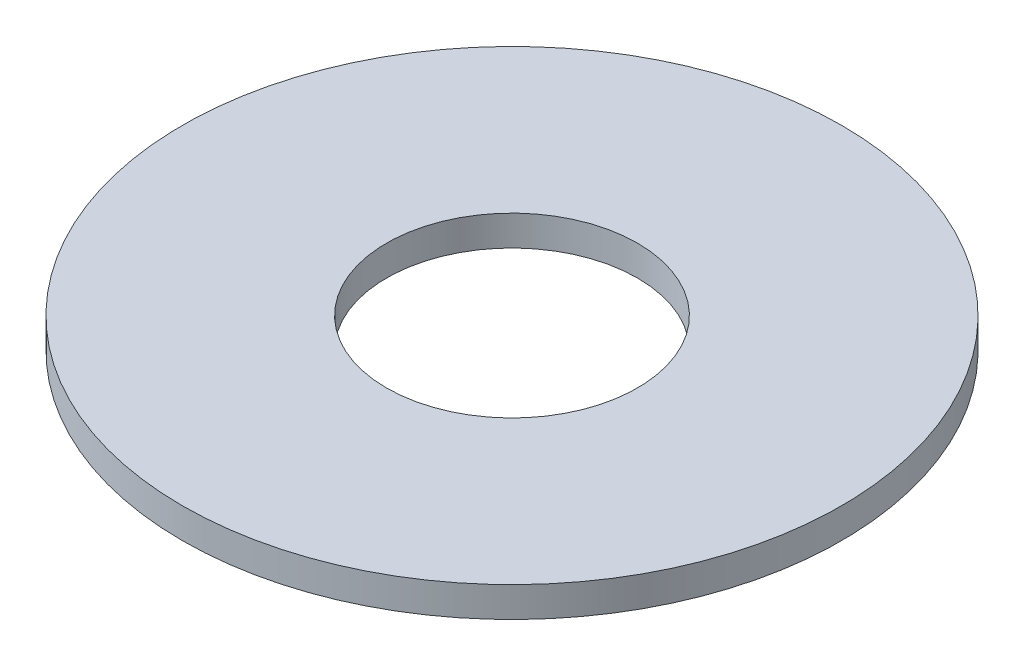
ISO-10303-21;
HEADER;
FILE_DESCRIPTION(('STEP AP214'),'2;1');
FILE_NAME('part.step','',(''),(''),'','','');
FILE_SCHEMA(('AUTOMOTIVE_DESIGN { 1 0 10303 214 1 1 1 1 }'));
ENDSEC;
DATA;
#1=APPLICATION_CONTEXT('core data for automotive mechanical design processes');
#2=APPLICATION_PROTOCOL_DEFINITION('international standard','automotive_design',2000,#1);
#3=PRODUCT_CONTEXT('',#1,'mechanical');
#4=PRODUCT('Part','Part','',(#3));
#5=PRODUCT_RELATED_PRODUCT_CATEGORY('part','',(#4));
#6=PRODUCT_DEFINITION_FORMATION('','',#4);
#7=PRODUCT_DEFINITION_CONTEXT('part definition',#1,'design');
#8=PRODUCT_DEFINITION('design','',#6,#7);
#9=PRODUCT_DEFINITION_SHAPE('','',#8);
#10=(LENGTH_UNIT() NAMED_UNIT(*) SI_UNIT(.MILLI.,.METRE.));
#11=(NAMED_UNIT(*) PLANE_ANGLE_UNIT() SI_UNIT($,.RADIAN.));
#12=(NAMED_UNIT(*) SI_UNIT($,.STERADIAN.) SOLID_ANGLE_UNIT());
#13=UNCERTAINTY_MEASURE_WITH_UNIT(LENGTH_MEASURE(1.E-05),#10,'distance_accuracy_value','');
#14=(GEOMETRIC_REPRESENTATION_CONTEXT(3) GLOBAL_UNCERTAINTY_ASSIGNED_CONTEXT((#13)) GLOBAL_UNIT_ASSIGNED_CONTEXT((#10,
#11,#12)) REPRESENTATION_CONTEXT('',''));
#15=CARTESIAN_POINT('',(0.,0.,0.));
#16=DIRECTION('',(0.,0.,1.));
#17=DIRECTION('',(1.,0.,0.));
#18=AXIS2_PLACEMENT_3D('',#15,#16,#17);
#19=CARTESIAN_POINT('',(0.,41.6341650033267,0.));
#20=DIRECTION('',(0.,1.,0.));
#21=DIRECTION('',(0.,0.,1.));
#22=AXIS2_PLACEMENT_3D('',#19,#20,#21);
#23=CYLINDRICAL_SURFACE('',#22,4.15000000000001);
#24=CARTESIAN_POINT('',(0.,0.,0.));
#25=DIRECTION('',(0.,1.,0.));
#26=DIRECTION('',(0.,0.,1.));
#27=AXIS2_PLACEMENT_3D('',#24,#25,#26);
#28=CIRCLE('',#27,4.15000000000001);
#29=CARTESIAN_POINT('',(0.,0.,4.15000000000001));
#30=VERTEX_POINT('',#29);
#31=EDGE_CURVE('E46',#30,#30,#28,.T.);
#32=ORIENTED_EDGE('',*,*,#31,.F.);
#33=EDGE_LOOP('',(#32));
#34=FACE_BOUND('',#33,.T.);
#35=CARTESIAN_POINT('',(0.,1.,0.));
#36=DIRECTION('',(0.,1.,0.));
#37=DIRECTION('',(0.,0.,1.));
#38=AXIS2_PLACEMENT_3D('',#35,#36,#37);
#39=CIRCLE('',#38,4.15000000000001);
#40=CARTESIAN_POINT('',(0.,1.,4.15000000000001));
#41=VERTEX_POINT('',#40);
#42=EDGE_CURVE('E10',#41,#41,#39,.T.);
#43=ORIENTED_EDGE('',*,*,#42,.T.);
#44=EDGE_LOOP('',(#43));
#45=FACE_BOUND('',#44,.T.);
#46=ADVANCED_FACE('F32',(#34,#45),#23,.F.);
#47=CARTESIAN_POINT('',(4.15000000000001,1.,0.));
#48=DIRECTION('',(0.,-1.,0.));
#49=DIRECTION('',(0.,0.,-1.));
#50=AXIS2_PLACEMENT_3D('',#47,#48,#49);
#51=PLANE('',#50);
#52=ORIENTED_EDGE('',*,*,#42,.F.);
#53=EDGE_LOOP('',(#52));
#54=FACE_BOUND('',#53,.T.);
#55=CARTESIAN_POINT('',(0.,1.,0.));
#56=DIRECTION('',(0.,1.,0.));
#57=DIRECTION('',(0.,0.,1.));
#58=AXIS2_PLACEMENT_3D('',#55,#56,#57);
#59=CIRCLE('',#58,10.9);
#60=CARTESIAN_POINT('',(0.,1.,10.9));
#61=VERTEX_POINT('',#60);
#62=EDGE_CURVE('E38',#61,#61,#59,.T.);
#63=ORIENTED_EDGE('',*,*,#62,.T.);
#64=EDGE_LOOP('',(#63));
#65=FACE_BOUND('',#64,.T.);
#66=ADVANCED_FACE('F55',(#54,#65),#51,.F.);
#67=CARTESIAN_POINT('',(0.,41.6341650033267,0.));
#68=DIRECTION('',(0.,1.,0.));
#69=DIRECTION('',(0.,0.,1.));
#70=AXIS2_PLACEMENT_3D('',#67,#68,#69);
#71=CYLINDRICAL_SURFACE('',#70,10.9);
#72=ORIENTED_EDGE('',*,*,#62,.F.);
#73=EDGE_LOOP('',(#72));
#74=FACE_BOUND('',#73,.T.);
#75=CARTESIAN_POINT('',(0.,0.,0.));
#76=DIRECTION('',(0.,1.,0.));
#77=DIRECTION('',(0.,0.,1.));
#78=AXIS2_PLACEMENT_3D('',#75,#76,#77);
#79=CIRCLE('',#78,10.9);
#80=CARTESIAN_POINT('',(0.,0.,10.9));
#81=VERTEX_POINT('',#80);
#82=EDGE_CURVE('E42',#81,#81,#79,.T.);
#83=ORIENTED_EDGE('',*,*,#82,.T.);
#84=EDGE_LOOP('',(#83));
#85=FACE_BOUND('',#84,.T.);
#86=ADVANCED_FACE('F59',(#74,#85),#71,.T.);
#87=CARTESIAN_POINT('',(4.15000000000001,0.,0.));
#88=DIRECTION('',(0.,1.,0.));
#89=DIRECTION('',(0.,0.,1.));
#90=AXIS2_PLACEMENT_3D('',#87,#88,#89);
#91=PLANE('',#90);
#92=ORIENTED_EDGE('',*,*,#82,.F.);
#93=EDGE_LOOP('',(#92));
#94=FACE_BOUND('',#93,.T.);
#95=ORIENTED_EDGE('',*,*,#31,.T.);
#96=EDGE_LOOP('',(#95));
#97=FACE_BOUND('',#96,.T.);
#98=ADVANCED_FACE('F52',(#94,#97),#91,.F.);
#99=CLOSED_SHELL('',(#46,#66,#86,#98));
#100=MANIFOLD_SOLID_BREP('B2',#99);
#101=ADVANCED_BREP_SHAPE_REPRESENTATION('',(#18,#100),#14);
#102=SHAPE_DEFINITION_REPRESENTATION(#9,#101);
ENDSEC;
END-ISO-10303-21;
